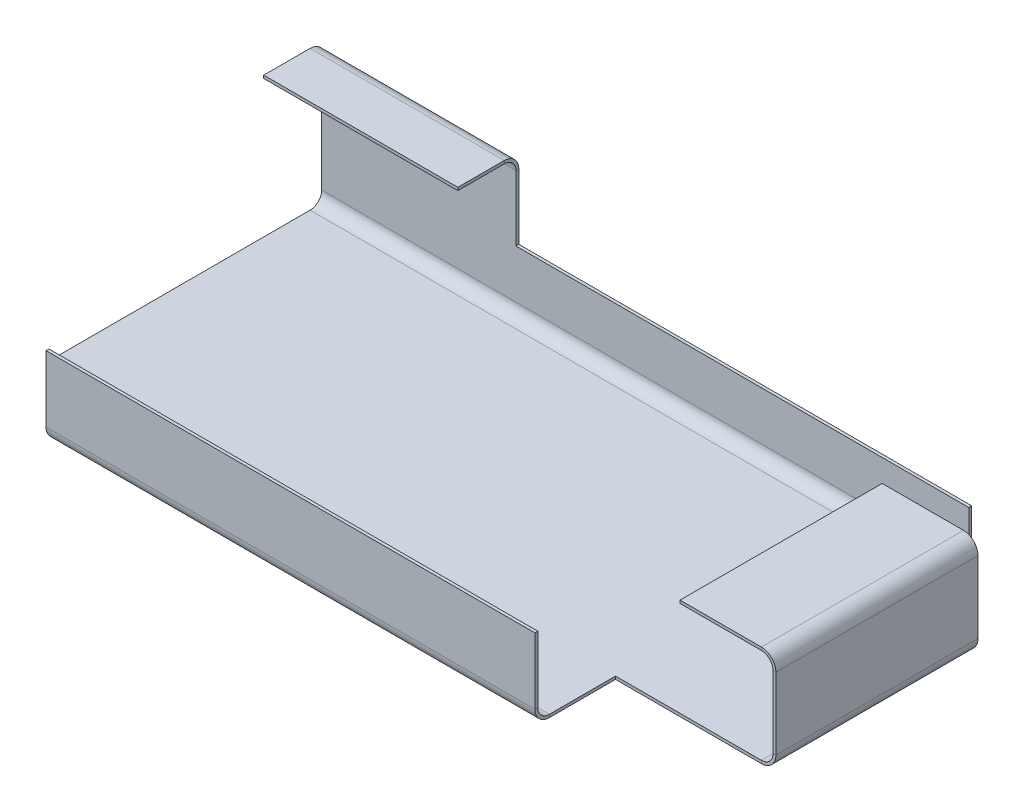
ISO-10303-21;
HEADER;
FILE_DESCRIPTION(('STEP AP214'),'2;1');
FILE_NAME('part.step','',(''),(''),'','','');
FILE_SCHEMA(('AUTOMOTIVE_DESIGN { 1 0 10303 214 1 1 1 1 }'));
ENDSEC;
DATA;
#1=APPLICATION_CONTEXT('core data for automotive mechanical design processes');
#2=APPLICATION_PROTOCOL_DEFINITION('international standard','automotive_design',2000,#1);
#3=PRODUCT_CONTEXT('',#1,'mechanical');
#4=PRODUCT('Part','Part','',(#3));
#5=PRODUCT_RELATED_PRODUCT_CATEGORY('part','',(#4));
#6=PRODUCT_DEFINITION_FORMATION('','',#4);
#7=PRODUCT_DEFINITION_CONTEXT('part definition',#1,'design');
#8=PRODUCT_DEFINITION('design','',#6,#7);
#9=PRODUCT_DEFINITION_SHAPE('','',#8);
#10=(LENGTH_UNIT() NAMED_UNIT(*) SI_UNIT(.MILLI.,.METRE.));
#11=(NAMED_UNIT(*) PLANE_ANGLE_UNIT() SI_UNIT($,.RADIAN.));
#12=(NAMED_UNIT(*) SI_UNIT($,.STERADIAN.) SOLID_ANGLE_UNIT());
#13=UNCERTAINTY_MEASURE_WITH_UNIT(LENGTH_MEASURE(1.E-05),#10,'distance_accuracy_value','');
#14=(GEOMETRIC_REPRESENTATION_CONTEXT(3) GLOBAL_UNCERTAINTY_ASSIGNED_CONTEXT((#13)) GLOBAL_UNIT_ASSIGNED_CONTEXT((#10,
#11,#12)) REPRESENTATION_CONTEXT('',''));
#15=CARTESIAN_POINT('',(0.,0.,0.));
#16=DIRECTION('',(0.,0.,1.));
#17=DIRECTION('',(1.,0.,0.));
#18=AXIS2_PLACEMENT_3D('',#15,#16,#17);
#19=CARTESIAN_POINT('',(0.,24.1533098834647,-35.2286793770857));
#20=DIRECTION('',(0.,0.,-1.));
#21=DIRECTION('',(1.,0.,0.));
#22=AXIS2_PLACEMENT_3D('',#19,#20,#21);
#23=PLANE('',#22);
#24=DIRECTION('',(-1.,0.,0.));
#25=VECTOR('',#24,1.);
#26=CARTESIAN_POINT('',(0.,24.6533098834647,-35.2286793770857));
#27=LINE('',#26,#25);
#28=CARTESIAN_POINT('',(33.4756358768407,24.6533098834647,-35.2286793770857));
#29=VERTEX_POINT('',#28);
#30=CARTESIAN_POINT('',(0.,24.6533098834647,-35.2286793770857));
#31=VERTEX_POINT('',#30);
#32=EDGE_CURVE('E70',#29,#31,#27,.T.);
#33=ORIENTED_EDGE('',*,*,#32,.T.);
#34=DIRECTION('',(0.,1.,0.));
#35=VECTOR('',#34,1.);
#36=CARTESIAN_POINT('',(0.,24.1533098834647,-35.2286793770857));
#37=LINE('',#36,#35);
#38=CARTESIAN_POINT('',(0.,24.1533098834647,-35.2286793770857));
#39=VERTEX_POINT('',#38);
#40=EDGE_CURVE('E375',#39,#31,#37,.T.);
#41=ORIENTED_EDGE('',*,*,#40,.F.);
#42=DIRECTION('',(-1.,0.,0.));
#43=VECTOR('',#42,1.);
#44=CARTESIAN_POINT('',(0.,24.1533098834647,-35.2286793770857));
#45=LINE('',#44,#43);
#46=CARTESIAN_POINT('',(33.4756358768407,24.1533098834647,-35.2286793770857));
#47=VERTEX_POINT('',#46);
#48=EDGE_CURVE('E369',#47,#39,#45,.T.);
#49=ORIENTED_EDGE('',*,*,#48,.F.);
#50=DIRECTION('',(0.,1.,0.));
#51=VECTOR('',#50,1.);
#52=CARTESIAN_POINT('',(33.4756358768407,24.1533098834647,-35.2286793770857));
#53=LINE('',#52,#51);
#54=EDGE_CURVE('E378',#47,#29,#53,.T.);
#55=ORIENTED_EDGE('',*,*,#54,.T.);
#56=EDGE_LOOP('',(#33,#41,#49,#55));
#57=FACE_BOUND('',#56,.T.);
#58=ADVANCED_FACE('F33',(#57),#23,.F.);
#59=CARTESIAN_POINT('',(0.,24.6533098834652,-113.96187884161));
#60=DIRECTION('',(0.,1.,0.));
#61=DIRECTION('',(0.,0.,1.));
#62=AXIS2_PLACEMENT_3D('',#59,#60,#61);
#63=PLANE('',#62);
#64=DIRECTION('',(0.,0.,1.));
#65=VECTOR('',#64,1.);
#66=CARTESIAN_POINT('',(33.4756358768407,24.6533098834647,-35.2286793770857));
#67=LINE('',#66,#65);
#68=CARTESIAN_POINT('',(33.4756358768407,24.6533098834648,-43.2272936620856));
#69=VERTEX_POINT('',#68);
#70=EDGE_CURVE('E11',#69,#29,#67,.T.);
#71=ORIENTED_EDGE('',*,*,#70,.F.);
#72=DIRECTION('',(-1.,0.,0.));
#73=VECTOR('',#72,1.);
#74=CARTESIAN_POINT('',(0.,24.6533098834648,-43.2272936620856));
#75=LINE('',#74,#73);
#76=CARTESIAN_POINT('',(0.,24.6533098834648,-43.2272936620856));
#77=VERTEX_POINT('',#76);
#78=EDGE_CURVE('E336',#69,#77,#75,.T.);
#79=ORIENTED_EDGE('',*,*,#78,.T.);
#80=DIRECTION('',(0.,0.,-1.));
#81=VECTOR('',#80,1.);
#82=CARTESIAN_POINT('',(0.,24.6533098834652,-113.96187884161));
#83=LINE('',#82,#81);
#84=EDGE_CURVE('E373',#31,#77,#83,.T.);
#85=ORIENTED_EDGE('',*,*,#84,.F.);
#86=ORIENTED_EDGE('',*,*,#32,.F.);
#87=EDGE_LOOP('',(#71,#79,#85,#86));
#88=FACE_BOUND('',#87,.T.);
#89=ADVANCED_FACE('F685',(#88),#63,.T.);
#90=CARTESIAN_POINT('',(0.,24.1533098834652,-113.96187884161));
#91=DIRECTION('',(1.,0.,0.));
#92=DIRECTION('',(0.,0.,1.));
#93=AXIS2_PLACEMENT_3D('',#90,#91,#92);
#94=PLANE('',#93);
#95=DIRECTION('',(0.,1.,0.));
#96=VECTOR('',#95,1.);
#97=CARTESIAN_POINT('',(0.,24.1533098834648,-43.2272936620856));
#98=LINE('',#97,#96);
#99=CARTESIAN_POINT('',(0.,24.1533098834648,-43.2272936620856));
#100=VERTEX_POINT('',#99);
#101=EDGE_CURVE('E381',#100,#77,#98,.T.);
#102=ORIENTED_EDGE('',*,*,#101,.F.);
#103=DIRECTION('',(0.,0.,-1.));
#104=VECTOR('',#103,1.);
#105=CARTESIAN_POINT('',(0.,24.1533098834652,-113.96187884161));
#106=LINE('',#105,#104);
#107=EDGE_CURVE('E43',#39,#100,#106,.T.);
#108=ORIENTED_EDGE('',*,*,#107,.F.);
#109=ORIENTED_EDGE('',*,*,#40,.T.);
#110=ORIENTED_EDGE('',*,*,#84,.T.);
#111=EDGE_LOOP('',(#102,#108,#109,#110));
#112=FACE_BOUND('',#111,.T.);
#113=ADVANCED_FACE('F690',(#112),#94,.F.);
#114=CARTESIAN_POINT('',(0.,24.1533098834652,-113.96187884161));
#115=DIRECTION('',(0.,1.,0.));
#116=DIRECTION('',(0.,0.,1.));
#117=AXIS2_PLACEMENT_3D('',#114,#115,#116);
#118=PLANE('',#117);
#119=DIRECTION('',(-1.,0.,0.));
#120=VECTOR('',#119,1.);
#121=CARTESIAN_POINT('',(0.,24.1533098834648,-43.2272936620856));
#122=LINE('',#121,#120);
#123=CARTESIAN_POINT('',(33.4756358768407,24.1533098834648,-43.2272936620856));
#124=VERTEX_POINT('',#123);
#125=EDGE_CURVE('E77',#124,#100,#122,.T.);
#126=ORIENTED_EDGE('',*,*,#125,.F.);
#127=DIRECTION('',(0.,0.,1.));
#128=VECTOR('',#127,1.);
#129=CARTESIAN_POINT('',(33.4756358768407,24.1533098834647,-35.2286793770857));
#130=LINE('',#129,#128);
#131=EDGE_CURVE('E371',#124,#47,#130,.T.);
#132=ORIENTED_EDGE('',*,*,#131,.T.);
#133=ORIENTED_EDGE('',*,*,#48,.T.);
#134=ORIENTED_EDGE('',*,*,#107,.T.);
#135=EDGE_LOOP('',(#126,#132,#133,#134));
#136=FACE_BOUND('',#135,.T.);
#137=ADVANCED_FACE('F697',(#136),#118,.F.);
#138=CARTESIAN_POINT('',(33.4756358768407,24.1533098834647,-35.2286793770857));
#139=DIRECTION('',(-1.,0.,0.));
#140=DIRECTION('',(0.,0.,-1.));
#141=AXIS2_PLACEMENT_3D('',#138,#139,#140);
#142=PLANE('',#141);
#143=DIRECTION('',(0.,-1.,0.));
#144=VECTOR('',#143,1.);
#145=CARTESIAN_POINT('',(33.4756358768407,24.1533098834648,-43.2272936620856));
#146=LINE('',#145,#144);
#147=EDGE_CURVE('E37',#69,#124,#146,.T.);
#148=ORIENTED_EDGE('',*,*,#147,.F.);
#149=ORIENTED_EDGE('',*,*,#70,.T.);
#150=ORIENTED_EDGE('',*,*,#54,.F.);
#151=ORIENTED_EDGE('',*,*,#131,.F.);
#152=EDGE_LOOP('',(#148,#149,#150,#151));
#153=FACE_BOUND('',#152,.T.);
#154=ADVANCED_FACE('F35',(#153),#142,.F.);
#155=CARTESIAN_POINT('',(106.992525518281,16.9021645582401,-34.8382046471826));
#156=DIRECTION('',(1.,0.,0.));
#157=DIRECTION('',(0.,0.,1.));
#158=AXIS2_PLACEMENT_3D('',#155,#156,#157);
#159=PLANE('',#158);
#160=DIRECTION('',(0.,0.,-1.));
#161=VECTOR('',#160,1.);
#162=CARTESIAN_POINT('',(106.992525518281,17.4021645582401,-34.8382046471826));
#163=LINE('',#162,#161);
#164=CARTESIAN_POINT('',(106.992525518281,17.4021645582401,0.));
#165=VERTEX_POINT('',#164);
#166=CARTESIAN_POINT('',(106.992525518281,17.4021645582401,-34.8382046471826));
#167=VERTEX_POINT('',#166);
#168=EDGE_CURVE('E106',#165,#167,#163,.T.);
#169=ORIENTED_EDGE('',*,*,#168,.T.);
#170=DIRECTION('',(0.,1.,0.));
#171=VECTOR('',#170,1.);
#172=CARTESIAN_POINT('',(106.992525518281,16.9021645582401,-34.8382046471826));
#173=LINE('',#172,#171);
#174=CARTESIAN_POINT('',(106.992525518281,16.9021645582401,-34.8382046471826));
#175=VERTEX_POINT('',#174);
#176=EDGE_CURVE('E399',#175,#167,#173,.T.);
#177=ORIENTED_EDGE('',*,*,#176,.F.);
#178=DIRECTION('',(0.,0.,-1.));
#179=VECTOR('',#178,1.);
#180=CARTESIAN_POINT('',(106.992525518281,16.9021645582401,-34.8382046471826));
#181=LINE('',#180,#179);
#182=CARTESIAN_POINT('',(106.992525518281,16.9021645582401,0.));
#183=VERTEX_POINT('',#182);
#184=EDGE_CURVE('E388',#183,#175,#181,.T.);
#185=ORIENTED_EDGE('',*,*,#184,.F.);
#186=DIRECTION('',(0.,1.,0.));
#187=VECTOR('',#186,1.);
#188=CARTESIAN_POINT('',(106.992525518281,16.9021645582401,0.));
#189=LINE('',#188,#187);
#190=EDGE_CURVE('E404',#183,#165,#189,.T.);
#191=ORIENTED_EDGE('',*,*,#190,.T.);
#192=EDGE_LOOP('',(#169,#177,#185,#191));
#193=FACE_BOUND('',#192,.T.);
#194=ADVANCED_FACE('F703',(#193),#159,.F.);
#195=CARTESIAN_POINT('',(262.279096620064,17.4021645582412,0.));
#196=DIRECTION('',(0.,1.,0.));
#197=DIRECTION('',(0.,0.,-1.));
#198=AXIS2_PLACEMENT_3D('',#195,#196,#197);
#199=PLANE('',#198);
#200=DIRECTION('',(-1.,0.,0.));
#201=VECTOR('',#200,1.);
#202=CARTESIAN_POINT('',(106.992525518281,17.4021645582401,0.));
#203=LINE('',#202,#201);
#204=CARTESIAN_POINT('',(121.011475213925,17.4021645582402,0.));
#205=VERTEX_POINT('',#204);
#206=EDGE_CURVE('E86',#205,#165,#203,.T.);
#207=ORIENTED_EDGE('',*,*,#206,.F.);
#208=DIRECTION('',(0.,0.,-1.));
#209=VECTOR('',#208,1.);
#210=CARTESIAN_POINT('',(121.011475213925,17.4021645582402,0.));
#211=LINE('',#210,#209);
#212=CARTESIAN_POINT('',(121.011475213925,17.4021645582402,-34.8382046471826));
#213=VERTEX_POINT('',#212);
#214=EDGE_CURVE('E401',#205,#213,#211,.T.);
#215=ORIENTED_EDGE('',*,*,#214,.T.);
#216=DIRECTION('',(1.,0.,0.));
#217=VECTOR('',#216,1.);
#218=CARTESIAN_POINT('',(150.742829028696,17.4021645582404,-34.8382046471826));
#219=LINE('',#218,#217);
#220=EDGE_CURVE('E397',#167,#213,#219,.T.);
#221=ORIENTED_EDGE('',*,*,#220,.F.);
#222=ORIENTED_EDGE('',*,*,#168,.F.);
#223=EDGE_LOOP('',(#207,#215,#221,#222));
#224=FACE_BOUND('',#223,.T.);
#225=ADVANCED_FACE('F707',(#224),#199,.T.);
#226=CARTESIAN_POINT('',(150.742829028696,16.9021645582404,-34.8382046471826));
#227=DIRECTION('',(0.,0.,1.));
#228=DIRECTION('',(-1.,0.,0.));
#229=AXIS2_PLACEMENT_3D('',#226,#227,#228);
#230=PLANE('',#229);
#231=DIRECTION('',(0.,1.,0.));
#232=VECTOR('',#231,1.);
#233=CARTESIAN_POINT('',(121.011475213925,16.9021645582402,-34.8382046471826));
#234=LINE('',#233,#232);
#235=CARTESIAN_POINT('',(121.011475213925,16.9021645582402,-34.8382046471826));
#236=VERTEX_POINT('',#235);
#237=EDGE_CURVE('E407',#236,#213,#234,.T.);
#238=ORIENTED_EDGE('',*,*,#237,.F.);
#239=DIRECTION('',(1.,0.,0.));
#240=VECTOR('',#239,1.);
#241=CARTESIAN_POINT('',(150.742829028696,16.9021645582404,-34.8382046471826));
#242=LINE('',#241,#240);
#243=EDGE_CURVE('E386',#175,#236,#242,.T.);
#244=ORIENTED_EDGE('',*,*,#243,.F.);
#245=ORIENTED_EDGE('',*,*,#176,.T.);
#246=ORIENTED_EDGE('',*,*,#220,.T.);
#247=EDGE_LOOP('',(#238,#244,#245,#246));
#248=FACE_BOUND('',#247,.T.);
#249=ADVANCED_FACE('F743',(#248),#230,.F.);
#250=CARTESIAN_POINT('',(262.279096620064,16.9021645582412,0.));
#251=DIRECTION('',(0.,1.,0.));
#252=DIRECTION('',(0.,0.,-1.));
#253=AXIS2_PLACEMENT_3D('',#250,#251,#252);
#254=PLANE('',#253);
#255=DIRECTION('',(0.,0.,-1.));
#256=VECTOR('',#255,1.);
#257=CARTESIAN_POINT('',(121.011475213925,16.9021645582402,0.));
#258=LINE('',#257,#256);
#259=CARTESIAN_POINT('',(121.011475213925,16.9021645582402,0.));
#260=VERTEX_POINT('',#259);
#261=EDGE_CURVE('E113',#260,#236,#258,.T.);
#262=ORIENTED_EDGE('',*,*,#261,.F.);
#263=DIRECTION('',(-1.,0.,0.));
#264=VECTOR('',#263,1.);
#265=CARTESIAN_POINT('',(106.992525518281,16.9021645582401,0.));
#266=LINE('',#265,#264);
#267=EDGE_CURVE('E395',#260,#183,#266,.T.);
#268=ORIENTED_EDGE('',*,*,#267,.T.);
#269=ORIENTED_EDGE('',*,*,#184,.T.);
#270=ORIENTED_EDGE('',*,*,#243,.T.);
#271=EDGE_LOOP('',(#262,#268,#269,#270));
#272=FACE_BOUND('',#271,.T.);
#273=ADVANCED_FACE('F747',(#272),#254,.F.);
#274=CARTESIAN_POINT('',(106.992525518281,16.9021645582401,0.));
#275=DIRECTION('',(0.,0.,-1.));
#276=DIRECTION('',(1.,0.,0.));
#277=AXIS2_PLACEMENT_3D('',#274,#275,#276);
#278=PLANE('',#277);
#279=DIRECTION('',(0.,-1.,0.));
#280=VECTOR('',#279,1.);
#281=CARTESIAN_POINT('',(121.011475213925,16.9021645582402,0.));
#282=LINE('',#281,#280);
#283=EDGE_CURVE('E358',#205,#260,#282,.T.);
#284=ORIENTED_EDGE('',*,*,#283,.F.);
#285=ORIENTED_EDGE('',*,*,#206,.T.);
#286=ORIENTED_EDGE('',*,*,#190,.F.);
#287=ORIENTED_EDGE('',*,*,#267,.F.);
#288=EDGE_LOOP('',(#284,#285,#286,#287));
#289=FACE_BOUND('',#288,.T.);
#290=ADVANCED_FACE('F751',(#289),#278,.F.);
#291=CARTESIAN_POINT('',(33.4756358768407,10.889089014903,-45.2272936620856));
#292=DIRECTION('',(0.,-1.,0.));
#293=DIRECTION('',(1.,0.,0.));
#294=AXIS2_PLACEMENT_3D('',#291,#292,#293);
#295=PLANE('',#294);
#296=DIRECTION('',(-1.,0.,0.));
#297=VECTOR('',#296,1.);
#298=CARTESIAN_POINT('',(33.4756358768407,10.889089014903,-45.7272936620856));
#299=LINE('',#298,#297);
#300=CARTESIAN_POINT('',(111.536267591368,10.889089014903,-45.7272936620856));
#301=VERTEX_POINT('',#300);
#302=CARTESIAN_POINT('',(33.4756358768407,10.889089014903,-45.7272936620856));
#303=VERTEX_POINT('',#302);
#304=EDGE_CURVE('E354',#301,#303,#299,.T.);
#305=ORIENTED_EDGE('',*,*,#304,.T.);
#306=DIRECTION('',(0.,0.,-1.));
#307=VECTOR('',#306,1.);
#308=CARTESIAN_POINT('',(33.4756358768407,10.889089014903,-45.2272936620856));
#309=LINE('',#308,#307);
#310=CARTESIAN_POINT('',(33.4756358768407,10.889089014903,-45.2272936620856));
#311=VERTEX_POINT('',#310);
#312=EDGE_CURVE('E324',#311,#303,#309,.T.);
#313=ORIENTED_EDGE('',*,*,#312,.F.);
#314=DIRECTION('',(-1.,0.,0.));
#315=VECTOR('',#314,1.);
#316=CARTESIAN_POINT('',(33.4756358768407,10.889089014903,-45.2272936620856));
#317=LINE('',#316,#315);
#318=CARTESIAN_POINT('',(111.536267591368,10.889089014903,-45.2272936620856));
#319=VERTEX_POINT('',#318);
#320=EDGE_CURVE('E417',#319,#311,#317,.T.);
#321=ORIENTED_EDGE('',*,*,#320,.F.);
#322=DIRECTION('',(0.,0.,-1.));
#323=VECTOR('',#322,1.);
#324=CARTESIAN_POINT('',(111.536267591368,10.889089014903,-45.2272936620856));
#325=LINE('',#324,#323);
#326=EDGE_CURVE('E352',#319,#301,#325,.T.);
#327=ORIENTED_EDGE('',*,*,#326,.T.);
#328=EDGE_LOOP('',(#305,#313,#321,#327));
#329=FACE_BOUND('',#328,.T.);
#330=ADVANCED_FACE('F720',(#329),#295,.F.);
#331=CARTESIAN_POINT('',(33.4756358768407,34.0789149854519,-45.2272936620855));
#332=DIRECTION('',(-1.,0.,0.));
#333=DIRECTION('',(0.,-1.,0.));
#334=AXIS2_PLACEMENT_3D('',#331,#332,#333);
#335=PLANE('',#334);
#336=DIRECTION('',(0.,1.,0.));
#337=VECTOR('',#336,1.);
#338=CARTESIAN_POINT('',(33.4756358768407,34.0789149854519,-45.7272936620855));
#339=LINE('',#338,#337);
#340=CARTESIAN_POINT('',(33.4756358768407,22.1533098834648,-45.7272936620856));
#341=VERTEX_POINT('',#340);
#342=EDGE_CURVE('E325',#303,#341,#339,.T.);
#343=ORIENTED_EDGE('',*,*,#342,.T.);
#344=DIRECTION('',(0.,0.,1.));
#345=VECTOR('',#344,1.);
#346=CARTESIAN_POINT('',(33.4756358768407,22.1533098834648,-45.2272936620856));
#347=LINE('',#346,#345);
#348=CARTESIAN_POINT('',(33.4756358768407,22.1533098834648,-45.2272936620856));
#349=VERTEX_POINT('',#348);
#350=EDGE_CURVE('E313',#341,#349,#347,.T.);
#351=ORIENTED_EDGE('',*,*,#350,.T.);
#352=DIRECTION('',(0.,1.,0.));
#353=VECTOR('',#352,1.);
#354=CARTESIAN_POINT('',(33.4756358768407,34.0789149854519,-45.2272936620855));
#355=LINE('',#354,#353);
#356=EDGE_CURVE('E364',#311,#349,#355,.T.);
#357=ORIENTED_EDGE('',*,*,#356,.F.);
#358=ORIENTED_EDGE('',*,*,#312,.T.);
#359=EDGE_LOOP('',(#343,#351,#357,#358));
#360=FACE_BOUND('',#359,.T.);
#361=ADVANCED_FACE('F350',(#360),#335,.F.);
#362=CARTESIAN_POINT('',(0.,-44.6542844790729,-45.7272936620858));
#363=DIRECTION('',(0.,0.,-1.));
#364=DIRECTION('',(0.,1.,0.));
#365=AXIS2_PLACEMENT_3D('',#362,#363,#364);
#366=PLANE('',#365);
#367=DIRECTION('',(-1.,0.,0.));
#368=VECTOR('',#367,1.);
#369=CARTESIAN_POINT('',(0.,22.1533098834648,-45.7272936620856));
#370=LINE('',#369,#368);
#371=CARTESIAN_POINT('',(0.,22.1533098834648,-45.7272936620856));
#372=VERTEX_POINT('',#371);
#373=EDGE_CURVE('E333',#341,#372,#370,.T.);
#374=ORIENTED_EDGE('',*,*,#373,.F.);
#375=ORIENTED_EDGE('',*,*,#342,.F.);
#376=ORIENTED_EDGE('',*,*,#304,.F.);
#377=DIRECTION('',(0.,1.,0.));
#378=VECTOR('',#377,1.);
#379=CARTESIAN_POINT('',(111.536267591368,10.889089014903,-45.7272936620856));
#380=LINE('',#379,#378);
#381=CARTESIAN_POINT('',(111.536267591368,2.50000000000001,-45.7272936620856));
#382=VERTEX_POINT('',#381);
#383=EDGE_CURVE('E122',#382,#301,#380,.T.);
#384=ORIENTED_EDGE('',*,*,#383,.F.);
#385=DIRECTION('',(-1.,0.,0.));
#386=VECTOR('',#385,1.);
#387=CARTESIAN_POINT('',(0.,2.50000000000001,-45.7272936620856));
#388=LINE('',#387,#386);
#389=CARTESIAN_POINT('',(0.,2.50000000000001,-45.7272936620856));
#390=VERTEX_POINT('',#389);
#391=EDGE_CURVE('E347',#382,#390,#388,.T.);
#392=ORIENTED_EDGE('',*,*,#391,.T.);
#393=DIRECTION('',(0.,-1.,0.));
#394=VECTOR('',#393,1.);
#395=CARTESIAN_POINT('',(0.,-44.6542844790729,-45.7272936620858));
#396=LINE('',#395,#394);
#397=EDGE_CURVE('E346',#372,#390,#396,.T.);
#398=ORIENTED_EDGE('',*,*,#397,.F.);
#399=EDGE_LOOP('',(#374,#375,#376,#384,#392,#398));
#400=FACE_BOUND('',#399,.T.);
#401=ADVANCED_FACE('F343',(#400),#366,.T.);
#402=CARTESIAN_POINT('',(0.,-44.6542844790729,-45.2272936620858));
#403=DIRECTION('',(1.,0.,0.));
#404=DIRECTION('',(0.,1.,0.));
#405=AXIS2_PLACEMENT_3D('',#402,#403,#404);
#406=PLANE('',#405);
#407=DIRECTION('',(0.,-1.,0.));
#408=VECTOR('',#407,1.);
#409=CARTESIAN_POINT('',(0.,-44.6542844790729,-45.2272936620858));
#410=LINE('',#409,#408);
#411=CARTESIAN_POINT('',(0.,22.1533098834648,-45.2272936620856));
#412=VERTEX_POINT('',#411);
#413=CARTESIAN_POINT('',(0.,2.50000000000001,-45.2272936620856));
#414=VERTEX_POINT('',#413);
#415=EDGE_CURVE('E360',#412,#414,#410,.T.);
#416=ORIENTED_EDGE('',*,*,#415,.F.);
#417=DIRECTION('',(0.,0.,-1.));
#418=VECTOR('',#417,1.);
#419=CARTESIAN_POINT('',(0.,22.1533098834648,-45.2272936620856));
#420=LINE('',#419,#418);
#421=EDGE_CURVE('E366',#412,#372,#420,.T.);
#422=ORIENTED_EDGE('',*,*,#421,.T.);
#423=ORIENTED_EDGE('',*,*,#397,.T.);
#424=DIRECTION('',(0.,0.,-1.));
#425=VECTOR('',#424,1.);
#426=CARTESIAN_POINT('',(0.,2.50000000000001,-45.2272936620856));
#427=LINE('',#426,#425);
#428=EDGE_CURVE('E431',#414,#390,#427,.T.);
#429=ORIENTED_EDGE('',*,*,#428,.F.);
#430=EDGE_LOOP('',(#416,#422,#423,#429));
#431=FACE_BOUND('',#430,.T.);
#432=ADVANCED_FACE('F672',(#431),#406,.F.);
#433=CARTESIAN_POINT('',(0.,-44.6542844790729,-45.2272936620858));
#434=DIRECTION('',(0.,0.,-1.));
#435=DIRECTION('',(0.,1.,0.));
#436=AXIS2_PLACEMENT_3D('',#433,#434,#435);
#437=PLANE('',#436);
#438=ORIENTED_EDGE('',*,*,#356,.T.);
#439=DIRECTION('',(-1.,0.,0.));
#440=VECTOR('',#439,1.);
#441=CARTESIAN_POINT('',(0.,22.1533098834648,-45.2272936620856));
#442=LINE('',#441,#440);
#443=EDGE_CURVE('E363',#349,#412,#442,.T.);
#444=ORIENTED_EDGE('',*,*,#443,.T.);
#445=ORIENTED_EDGE('',*,*,#415,.T.);
#446=DIRECTION('',(-1.,0.,0.));
#447=VECTOR('',#446,1.);
#448=CARTESIAN_POINT('',(0.,2.50000000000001,-45.2272936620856));
#449=LINE('',#448,#447);
#450=CARTESIAN_POINT('',(111.536267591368,2.50000000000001,-45.2272936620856));
#451=VERTEX_POINT('',#450);
#452=EDGE_CURVE('E145',#451,#414,#449,.T.);
#453=ORIENTED_EDGE('',*,*,#452,.F.);
#454=DIRECTION('',(0.,1.,0.));
#455=VECTOR('',#454,1.);
#456=CARTESIAN_POINT('',(111.536267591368,10.889089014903,-45.2272936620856));
#457=LINE('',#456,#455);
#458=EDGE_CURVE('E362',#451,#319,#457,.T.);
#459=ORIENTED_EDGE('',*,*,#458,.T.);
#460=ORIENTED_EDGE('',*,*,#320,.T.);
#461=EDGE_LOOP('',(#438,#444,#445,#453,#459,#460));
#462=FACE_BOUND('',#461,.T.);
#463=ADVANCED_FACE('F717',(#462),#437,.F.);
#464=CARTESIAN_POINT('',(111.536267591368,10.889089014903,-45.2272936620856));
#465=DIRECTION('',(-1.,0.,0.));
#466=DIRECTION('',(0.,-1.,0.));
#467=AXIS2_PLACEMENT_3D('',#464,#465,#466);
#468=PLANE('',#467);
#469=DIRECTION('',(0.,0.,1.));
#470=VECTOR('',#469,1.);
#471=CARTESIAN_POINT('',(111.536267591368,2.50000000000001,-45.2272936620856));
#472=LINE('',#471,#470);
#473=EDGE_CURVE('E149',#382,#451,#472,.T.);
#474=ORIENTED_EDGE('',*,*,#473,.F.);
#475=ORIENTED_EDGE('',*,*,#383,.T.);
#476=ORIENTED_EDGE('',*,*,#326,.F.);
#477=ORIENTED_EDGE('',*,*,#458,.F.);
#478=EDGE_LOOP('',(#474,#475,#476,#477));
#479=FACE_BOUND('',#478,.T.);
#480=ADVANCED_FACE('F721',(#479),#468,.F.);
#481=CARTESIAN_POINT('',(123.511475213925,-122.438466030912,0.));
#482=DIRECTION('',(1.,0.,0.));
#483=DIRECTION('',(0.,0.,-1.));
#484=AXIS2_PLACEMENT_3D('',#481,#482,#483);
#485=PLANE('',#484);
#486=DIRECTION('',(0.,0.,-1.));
#487=VECTOR('',#486,1.);
#488=CARTESIAN_POINT('',(123.511475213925,14.9021645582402,0.));
#489=LINE('',#488,#487);
#490=CARTESIAN_POINT('',(123.511475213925,14.9021645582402,0.));
#491=VERTEX_POINT('',#490);
#492=CARTESIAN_POINT('',(123.511475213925,14.9021645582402,-34.8382046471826));
#493=VERTEX_POINT('',#492);
#494=EDGE_CURVE('E448',#491,#493,#489,.T.);
#495=ORIENTED_EDGE('',*,*,#494,.F.);
#496=DIRECTION('',(0.,1.,0.));
#497=VECTOR('',#496,1.);
#498=CARTESIAN_POINT('',(123.511475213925,32.8481050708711,0.));
#499=LINE('',#498,#497);
#500=CARTESIAN_POINT('',(123.511475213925,2.5,0.));
#501=VERTEX_POINT('',#500);
#502=EDGE_CURVE('E436',#501,#491,#499,.T.);
#503=ORIENTED_EDGE('',*,*,#502,.F.);
#504=DIRECTION('',(0.,0.,-1.));
#505=VECTOR('',#504,1.);
#506=CARTESIAN_POINT('',(123.511475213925,2.5,0.));
#507=LINE('',#506,#505);
#508=CARTESIAN_POINT('',(123.511475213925,2.50000000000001,-34.8382046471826));
#509=VERTEX_POINT('',#508);
#510=EDGE_CURVE('E446',#501,#509,#507,.T.);
#511=ORIENTED_EDGE('',*,*,#510,.T.);
#512=DIRECTION('',(0.,-1.,0.));
#513=VECTOR('',#512,1.);
#514=CARTESIAN_POINT('',(123.511475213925,-10.9021984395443,-34.8382046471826));
#515=LINE('',#514,#513);
#516=EDGE_CURVE('E391',#493,#509,#515,.T.);
#517=ORIENTED_EDGE('',*,*,#516,.F.);
#518=EDGE_LOOP('',(#495,#503,#511,#517));
#519=FACE_BOUND('',#518,.T.);
#520=ADVANCED_FACE('F581',(#519),#485,.T.);
#521=CARTESIAN_POINT('',(123.011475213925,-10.9021984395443,-34.8382046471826));
#522=DIRECTION('',(0.,0.,1.));
#523=DIRECTION('',(0.,1.,0.));
#524=AXIS2_PLACEMENT_3D('',#521,#522,#523);
#525=PLANE('',#524);
#526=DIRECTION('',(0.,-1.,0.));
#527=VECTOR('',#526,1.);
#528=CARTESIAN_POINT('',(123.011475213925,-10.9021984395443,-34.8382046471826));
#529=LINE('',#528,#527);
#530=CARTESIAN_POINT('',(123.011475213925,14.9021645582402,-34.8382046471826));
#531=VERTEX_POINT('',#530);
#532=CARTESIAN_POINT('',(123.011475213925,2.5,-34.8382046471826));
#533=VERTEX_POINT('',#532);
#534=EDGE_CURVE('E157',#531,#533,#529,.T.);
#535=ORIENTED_EDGE('',*,*,#534,.F.);
#536=DIRECTION('',(1.,0.,0.));
#537=VECTOR('',#536,1.);
#538=CARTESIAN_POINT('',(123.011475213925,14.9021645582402,-34.8382046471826));
#539=LINE('',#538,#537);
#540=EDGE_CURVE('E442',#531,#493,#539,.T.);
#541=ORIENTED_EDGE('',*,*,#540,.T.);
#542=ORIENTED_EDGE('',*,*,#516,.T.);
#543=DIRECTION('',(1.,0.,0.));
#544=VECTOR('',#543,1.);
#545=CARTESIAN_POINT('',(123.011475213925,2.5,-34.8382046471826));
#546=LINE('',#545,#544);
#547=EDGE_CURVE('E454',#533,#509,#546,.T.);
#548=ORIENTED_EDGE('',*,*,#547,.F.);
#549=EDGE_LOOP('',(#535,#541,#542,#548));
#550=FACE_BOUND('',#549,.T.);
#551=ADVANCED_FACE('F728',(#550),#525,.F.);
#552=CARTESIAN_POINT('',(123.011475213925,-122.438466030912,0.));
#553=DIRECTION('',(1.,0.,0.));
#554=DIRECTION('',(0.,0.,-1.));
#555=AXIS2_PLACEMENT_3D('',#552,#553,#554);
#556=PLANE('',#555);
#557=DIRECTION('',(0.,1.,0.));
#558=VECTOR('',#557,1.);
#559=CARTESIAN_POINT('',(123.011475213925,32.8481050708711,0.));
#560=LINE('',#559,#558);
#561=CARTESIAN_POINT('',(123.011475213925,2.5,0.));
#562=VERTEX_POINT('',#561);
#563=CARTESIAN_POINT('',(123.011475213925,14.9021645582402,0.));
#564=VERTEX_POINT('',#563);
#565=EDGE_CURVE('E439',#562,#564,#560,.T.);
#566=ORIENTED_EDGE('',*,*,#565,.T.);
#567=DIRECTION('',(0.,0.,-1.));
#568=VECTOR('',#567,1.);
#569=CARTESIAN_POINT('',(123.011475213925,14.9021645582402,0.));
#570=LINE('',#569,#568);
#571=EDGE_CURVE('E438',#564,#531,#570,.T.);
#572=ORIENTED_EDGE('',*,*,#571,.T.);
#573=ORIENTED_EDGE('',*,*,#534,.T.);
#574=DIRECTION('',(0.,0.,-1.));
#575=VECTOR('',#574,1.);
#576=CARTESIAN_POINT('',(123.011475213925,2.5,0.));
#577=LINE('',#576,#575);
#578=EDGE_CURVE('E167',#562,#533,#577,.T.);
#579=ORIENTED_EDGE('',*,*,#578,.F.);
#580=EDGE_LOOP('',(#566,#572,#573,#579));
#581=FACE_BOUND('',#580,.T.);
#582=ADVANCED_FACE('F735',(#581),#556,.F.);
#583=CARTESIAN_POINT('',(123.011475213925,32.8481050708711,0.));
#584=DIRECTION('',(0.,0.,-1.));
#585=DIRECTION('',(0.,-1.,0.));
#586=AXIS2_PLACEMENT_3D('',#583,#584,#585);
#587=PLANE('',#586);
#588=ORIENTED_EDGE('',*,*,#502,.T.);
#589=DIRECTION('',(-1.,0.,0.));
#590=VECTOR('',#589,1.);
#591=CARTESIAN_POINT('',(123.011475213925,14.9021645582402,0.));
#592=LINE('',#591,#590);
#593=EDGE_CURVE('E435',#491,#564,#592,.T.);
#594=ORIENTED_EDGE('',*,*,#593,.T.);
#595=ORIENTED_EDGE('',*,*,#565,.F.);
#596=DIRECTION('',(-1.,0.,0.));
#597=VECTOR('',#596,1.);
#598=CARTESIAN_POINT('',(123.011475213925,2.5,0.));
#599=LINE('',#598,#597);
#600=EDGE_CURVE('E174',#501,#562,#599,.T.);
#601=ORIENTED_EDGE('',*,*,#600,.F.);
#602=EDGE_LOOP('',(#588,#594,#595,#601));
#603=FACE_BOUND('',#602,.T.);
#604=ADVANCED_FACE('F567',(#603),#587,.F.);
#605=CARTESIAN_POINT('',(95.8725786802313,13.9046528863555,13.4046528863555));
#606=DIRECTION('',(0.,-1.,0.));
#607=DIRECTION('',(-1.,0.,0.));
#608=AXIS2_PLACEMENT_3D('',#605,#606,#607);
#609=PLANE('',#608);
#610=DIRECTION('',(1.,0.,0.));
#611=VECTOR('',#610,1.);
#612=CARTESIAN_POINT('',(95.8725786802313,13.9046528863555,13.9046528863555));
#613=LINE('',#612,#611);
#614=CARTESIAN_POINT('',(11.6127348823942,13.9046528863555,13.9046528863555));
#615=VERTEX_POINT('',#614);
#616=CARTESIAN_POINT('',(95.8725786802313,13.9046528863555,13.9046528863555));
#617=VERTEX_POINT('',#616);
#618=EDGE_CURVE('E554',#615,#617,#613,.T.);
#619=ORIENTED_EDGE('',*,*,#618,.T.);
#620=DIRECTION('',(0.,0.,1.));
#621=VECTOR('',#620,1.);
#622=CARTESIAN_POINT('',(95.8725786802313,13.9046528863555,13.4046528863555));
#623=LINE('',#622,#621);
#624=CARTESIAN_POINT('',(95.8725786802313,13.9046528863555,13.4046528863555));
#625=VERTEX_POINT('',#624);
#626=EDGE_CURVE('E546',#625,#617,#623,.T.);
#627=ORIENTED_EDGE('',*,*,#626,.F.);
#628=DIRECTION('',(1.,0.,0.));
#629=VECTOR('',#628,1.);
#630=CARTESIAN_POINT('',(95.8725786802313,13.9046528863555,13.4046528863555));
#631=LINE('',#630,#629);
#632=CARTESIAN_POINT('',(11.6127348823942,13.9046528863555,13.4046528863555));
#633=VERTEX_POINT('',#632);
#634=EDGE_CURVE('E540',#633,#625,#631,.T.);
#635=ORIENTED_EDGE('',*,*,#634,.F.);
#636=DIRECTION('',(0.,0.,1.));
#637=VECTOR('',#636,1.);
#638=CARTESIAN_POINT('',(11.6127348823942,13.9046528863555,13.4046528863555));
#639=LINE('',#638,#637);
#640=EDGE_CURVE('E552',#633,#615,#639,.T.);
#641=ORIENTED_EDGE('',*,*,#640,.T.);
#642=EDGE_LOOP('',(#619,#627,#635,#641));
#643=FACE_BOUND('',#642,.T.);
#644=ADVANCED_FACE('F739',(#643),#609,.F.);
#645=CARTESIAN_POINT('',(0.,-12.8316437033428,13.9046528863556));
#646=DIRECTION('',(0.,0.,1.));
#647=DIRECTION('',(0.,-1.,0.));
#648=AXIS2_PLACEMENT_3D('',#645,#646,#647);
#649=PLANE('',#648);
#650=DIRECTION('',(0.,1.,0.));
#651=VECTOR('',#650,1.);
#652=CARTESIAN_POINT('',(11.6127348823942,13.9046528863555,13.9046528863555));
#653=LINE('',#652,#651);
#654=CARTESIAN_POINT('',(11.6127348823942,2.50000000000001,13.9046528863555));
#655=VERTEX_POINT('',#654);
#656=EDGE_CURVE('E183',#655,#615,#653,.T.);
#657=ORIENTED_EDGE('',*,*,#656,.F.);
#658=DIRECTION('',(1.,0.,0.));
#659=VECTOR('',#658,1.);
#660=CARTESIAN_POINT('',(0.,2.50000000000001,13.9046528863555));
#661=LINE('',#660,#659);
#662=CARTESIAN_POINT('',(95.8725786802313,2.50000000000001,13.9046528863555));
#663=VERTEX_POINT('',#662);
#664=EDGE_CURVE('E549',#655,#663,#661,.T.);
#665=ORIENTED_EDGE('',*,*,#664,.T.);
#666=DIRECTION('',(0.,-1.,0.));
#667=VECTOR('',#666,1.);
#668=CARTESIAN_POINT('',(95.8725786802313,-12.8316437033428,13.9046528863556));
#669=LINE('',#668,#667);
#670=EDGE_CURVE('E544',#617,#663,#669,.T.);
#671=ORIENTED_EDGE('',*,*,#670,.F.);
#672=ORIENTED_EDGE('',*,*,#618,.F.);
#673=EDGE_LOOP('',(#657,#665,#671,#672));
#674=FACE_BOUND('',#673,.T.);
#675=ADVANCED_FACE('F803',(#674),#649,.T.);
#676=CARTESIAN_POINT('',(95.8725786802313,-12.8316437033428,13.4046528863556));
#677=DIRECTION('',(-1.,0.,0.));
#678=DIRECTION('',(0.,1.,0.));
#679=AXIS2_PLACEMENT_3D('',#676,#677,#678);
#680=PLANE('',#679);
#681=DIRECTION('',(0.,0.,1.));
#682=VECTOR('',#681,1.);
#683=CARTESIAN_POINT('',(95.8725786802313,2.50000000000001,13.4046528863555));
#684=LINE('',#683,#682);
#685=CARTESIAN_POINT('',(95.8725786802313,2.50000000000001,13.4046528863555));
#686=VERTEX_POINT('',#685);
#687=EDGE_CURVE('E205',#686,#663,#684,.T.);
#688=ORIENTED_EDGE('',*,*,#687,.F.);
#689=DIRECTION('',(0.,-1.,0.));
#690=VECTOR('',#689,1.);
#691=CARTESIAN_POINT('',(95.8725786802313,-12.8316437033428,13.4046528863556));
#692=LINE('',#691,#690);
#693=EDGE_CURVE('E538',#625,#686,#692,.T.);
#694=ORIENTED_EDGE('',*,*,#693,.F.);
#695=ORIENTED_EDGE('',*,*,#626,.T.);
#696=ORIENTED_EDGE('',*,*,#670,.T.);
#697=EDGE_LOOP('',(#688,#694,#695,#696));
#698=FACE_BOUND('',#697,.T.);
#699=ADVANCED_FACE('F813',(#698),#680,.F.);
#700=CARTESIAN_POINT('',(0.,-12.8316437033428,13.4046528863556));
#701=DIRECTION('',(0.,0.,1.));
#702=DIRECTION('',(0.,-1.,0.));
#703=AXIS2_PLACEMENT_3D('',#700,#701,#702);
#704=PLANE('',#703);
#705=DIRECTION('',(1.,0.,0.));
#706=VECTOR('',#705,1.);
#707=CARTESIAN_POINT('',(0.,2.50000000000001,13.4046528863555));
#708=LINE('',#707,#706);
#709=CARTESIAN_POINT('',(11.6127348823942,2.50000000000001,13.4046528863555));
#710=VERTEX_POINT('',#709);
#711=EDGE_CURVE('E557',#710,#686,#708,.T.);
#712=ORIENTED_EDGE('',*,*,#711,.F.);
#713=DIRECTION('',(0.,1.,0.));
#714=VECTOR('',#713,1.);
#715=CARTESIAN_POINT('',(11.6127348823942,13.9046528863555,13.4046528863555));
#716=LINE('',#715,#714);
#717=EDGE_CURVE('E542',#710,#633,#716,.T.);
#718=ORIENTED_EDGE('',*,*,#717,.T.);
#719=ORIENTED_EDGE('',*,*,#634,.T.);
#720=ORIENTED_EDGE('',*,*,#693,.T.);
#721=EDGE_LOOP('',(#712,#718,#719,#720));
#722=FACE_BOUND('',#721,.T.);
#723=ADVANCED_FACE('F823',(#722),#704,.F.);
#724=CARTESIAN_POINT('',(11.6127348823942,13.9046528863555,13.4046528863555));
#725=DIRECTION('',(1.,0.,0.));
#726=DIRECTION('',(0.,-1.,0.));
#727=AXIS2_PLACEMENT_3D('',#724,#725,#726);
#728=PLANE('',#727);
#729=DIRECTION('',(0.,0.,-1.));
#730=VECTOR('',#729,1.);
#731=CARTESIAN_POINT('',(11.6127348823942,2.50000000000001,13.4046528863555));
#732=LINE('',#731,#730);
#733=EDGE_CURVE('E209',#655,#710,#732,.T.);
#734=ORIENTED_EDGE('',*,*,#733,.F.);
#735=ORIENTED_EDGE('',*,*,#656,.T.);
#736=ORIENTED_EDGE('',*,*,#640,.F.);
#737=ORIENTED_EDGE('',*,*,#717,.F.);
#738=EDGE_LOOP('',(#734,#735,#736,#737));
#739=FACE_BOUND('',#738,.T.);
#740=ADVANCED_FACE('F832',(#739),#728,.F.);
#741=CARTESIAN_POINT('',(0.,0.5,0.));
#742=DIRECTION('',(0.,-1.,0.));
#743=DIRECTION('',(0.,0.,-1.));
#744=AXIS2_PLACEMENT_3D('',#741,#742,#743);
#745=PLANE('',#744);
#746=DIRECTION('',(0.,0.,-1.));
#747=VECTOR('',#746,1.);
#748=CARTESIAN_POINT('',(111.536267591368,0.5,-55.5433734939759));
#749=LINE('',#748,#747);
#750=CARTESIAN_POINT('',(111.536267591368,0.5,-34.8382046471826));
#751=VERTEX_POINT('',#750);
#752=CARTESIAN_POINT('',(111.536267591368,0.5,-43.2272936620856));
#753=VERTEX_POINT('',#752);
#754=EDGE_CURVE('E462',#751,#753,#749,.T.);
#755=ORIENTED_EDGE('',*,*,#754,.T.);
#756=DIRECTION('',(-1.,0.,0.));
#757=VECTOR('',#756,1.);
#758=CARTESIAN_POINT('',(0.,0.5,-43.2272936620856));
#759=LINE('',#758,#757);
#760=CARTESIAN_POINT('',(0.,0.5,-43.2272936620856));
#761=VERTEX_POINT('',#760);
#762=EDGE_CURVE('E520',#753,#761,#759,.T.);
#763=ORIENTED_EDGE('',*,*,#762,.T.);
#764=DIRECTION('',(0.,0.,1.));
#765=VECTOR('',#764,1.);
#766=CARTESIAN_POINT('',(0.,0.5,0.));
#767=LINE('',#766,#765);
#768=CARTESIAN_POINT('',(0.,0.5,0.));
#769=VERTEX_POINT('',#768);
#770=EDGE_CURVE('E464',#761,#769,#767,.T.);
#771=ORIENTED_EDGE('',*,*,#770,.T.);
#772=DIRECTION('',(1.,0.,0.));
#773=VECTOR('',#772,1.);
#774=CARTESIAN_POINT('',(11.6127348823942,0.5,0.));
#775=LINE('',#774,#773);
#776=CARTESIAN_POINT('',(11.6127348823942,0.5,0.));
#777=VERTEX_POINT('',#776);
#778=EDGE_CURVE('E534',#769,#777,#775,.T.);
#779=ORIENTED_EDGE('',*,*,#778,.T.);
#780=DIRECTION('',(0.,0.,1.));
#781=VECTOR('',#780,1.);
#782=CARTESIAN_POINT('',(11.6127348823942,0.5,26.7362965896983));
#783=LINE('',#782,#781);
#784=CARTESIAN_POINT('',(11.6127348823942,0.5,11.4046528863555));
#785=VERTEX_POINT('',#784);
#786=EDGE_CURVE('E531',#777,#785,#783,.T.);
#787=ORIENTED_EDGE('',*,*,#786,.T.);
#788=DIRECTION('',(1.,0.,0.));
#789=VECTOR('',#788,1.);
#790=CARTESIAN_POINT('',(0.,0.5,11.4046528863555));
#791=LINE('',#790,#789);
#792=CARTESIAN_POINT('',(95.8725786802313,0.5,11.4046528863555));
#793=VERTEX_POINT('',#792);
#794=EDGE_CURVE('E491',#785,#793,#791,.T.);
#795=ORIENTED_EDGE('',*,*,#794,.T.);
#796=DIRECTION('',(0.,0.,-1.));
#797=VECTOR('',#796,1.);
#798=CARTESIAN_POINT('',(95.8725786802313,0.5,0.));
#799=LINE('',#798,#797);
#800=CARTESIAN_POINT('',(95.8725786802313,0.5,0.));
#801=VERTEX_POINT('',#800);
#802=EDGE_CURVE('E528',#793,#801,#799,.T.);
#803=ORIENTED_EDGE('',*,*,#802,.T.);
#804=DIRECTION('',(1.,0.,0.));
#805=VECTOR('',#804,1.);
#806=CARTESIAN_POINT('',(155.286571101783,0.5,0.));
#807=LINE('',#806,#805);
#808=CARTESIAN_POINT('',(121.011475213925,0.500000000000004,0.));
#809=VERTEX_POINT('',#808);
#810=EDGE_CURVE('E530',#801,#809,#807,.T.);
#811=ORIENTED_EDGE('',*,*,#810,.T.);
#812=DIRECTION('',(0.,0.,-1.));
#813=VECTOR('',#812,1.);
#814=CARTESIAN_POINT('',(121.011475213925,0.5,0.));
#815=LINE('',#814,#813);
#816=CARTESIAN_POINT('',(121.011475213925,0.500000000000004,-34.8382046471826));
#817=VERTEX_POINT('',#816);
#818=EDGE_CURVE('E509',#809,#817,#815,.T.);
#819=ORIENTED_EDGE('',*,*,#818,.T.);
#820=DIRECTION('',(-1.,0.,0.));
#821=VECTOR('',#820,1.);
#822=CARTESIAN_POINT('',(111.536267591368,0.5,-34.8382046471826));
#823=LINE('',#822,#821);
#824=EDGE_CURVE('E465',#817,#751,#823,.T.);
#825=ORIENTED_EDGE('',*,*,#824,.T.);
#826=EDGE_LOOP('',(#755,#763,#771,#779,#787,#795,#803,#811,#819,#825));
#827=FACE_BOUND('',#826,.T.);
#828=ADVANCED_FACE('F626',(#827),#745,.F.);
#829=CARTESIAN_POINT('',(111.536267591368,0.5,-55.5433734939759));
#830=DIRECTION('',(-1.,0.,0.));
#831=DIRECTION('',(0.,0.,1.));
#832=AXIS2_PLACEMENT_3D('',#829,#830,#831);
#833=PLANE('',#832);
#834=DIRECTION('',(0.,0.,-1.));
#835=VECTOR('',#834,1.);
#836=CARTESIAN_POINT('',(111.536267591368,0.,-55.5433734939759));
#837=LINE('',#836,#835);
#838=CARTESIAN_POINT('',(111.536267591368,0.,-34.8382046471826));
#839=VERTEX_POINT('',#838);
#840=CARTESIAN_POINT('',(111.536267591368,0.,-43.2272936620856));
#841=VERTEX_POINT('',#840);
#842=EDGE_CURVE('E458',#839,#841,#837,.T.);
#843=ORIENTED_EDGE('',*,*,#842,.T.);
#844=DIRECTION('',(0.,1.,0.));
#845=VECTOR('',#844,1.);
#846=CARTESIAN_POINT('',(111.536267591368,0.500000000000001,-43.2272936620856));
#847=LINE('',#846,#845);
#848=EDGE_CURVE('E517',#841,#753,#847,.T.);
#849=ORIENTED_EDGE('',*,*,#848,.T.);
#850=ORIENTED_EDGE('',*,*,#754,.F.);
#851=DIRECTION('',(0.,-1.,0.));
#852=VECTOR('',#851,1.);
#853=CARTESIAN_POINT('',(111.536267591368,0.5,-34.8382046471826));
#854=LINE('',#853,#852);
#855=EDGE_CURVE('E473',#751,#839,#854,.T.);
#856=ORIENTED_EDGE('',*,*,#855,.T.);
#857=EDGE_LOOP('',(#843,#849,#850,#856));
#858=FACE_BOUND('',#857,.T.);
#859=ADVANCED_FACE('F646',(#858),#833,.F.);
#860=CARTESIAN_POINT('',(0.,0.5,0.));
#861=DIRECTION('',(1.,0.,0.));
#862=DIRECTION('',(0.,0.,-1.));
#863=AXIS2_PLACEMENT_3D('',#860,#861,#862);
#864=PLANE('',#863);
#865=ORIENTED_EDGE('',*,*,#770,.F.);
#866=DIRECTION('',(0.,-1.,0.));
#867=VECTOR('',#866,1.);
#868=CARTESIAN_POINT('',(0.,0.499999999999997,-43.2272936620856));
#869=LINE('',#868,#867);
#870=CARTESIAN_POINT('',(0.,0.,-43.2272936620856));
#871=VERTEX_POINT('',#870);
#872=EDGE_CURVE('E514',#761,#871,#869,.T.);
#873=ORIENTED_EDGE('',*,*,#872,.T.);
#874=DIRECTION('',(0.,0.,1.));
#875=VECTOR('',#874,1.);
#876=CARTESIAN_POINT('',(0.,0.,0.));
#877=LINE('',#876,#875);
#878=CARTESIAN_POINT('',(0.,0.,0.));
#879=VERTEX_POINT('',#878);
#880=EDGE_CURVE('E421',#871,#879,#877,.T.);
#881=ORIENTED_EDGE('',*,*,#880,.T.);
#882=DIRECTION('',(0.,-1.,0.));
#883=VECTOR('',#882,1.);
#884=CARTESIAN_POINT('',(0.,0.5,0.));
#885=LINE('',#884,#883);
#886=EDGE_CURVE('E466',#769,#879,#885,.T.);
#887=ORIENTED_EDGE('',*,*,#886,.F.);
#888=EDGE_LOOP('',(#865,#873,#881,#887));
#889=FACE_BOUND('',#888,.T.);
#890=ADVANCED_FACE('F617',(#889),#864,.F.);
#891=CARTESIAN_POINT('',(155.286571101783,0.5,0.));
#892=DIRECTION('',(0.,0.,-1.));
#893=DIRECTION('',(-1.,0.,0.));
#894=AXIS2_PLACEMENT_3D('',#891,#892,#893);
#895=PLANE('',#894);
#896=DIRECTION('',(1.,0.,0.));
#897=VECTOR('',#896,1.);
#898=CARTESIAN_POINT('',(155.286571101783,0.,0.));
#899=LINE('',#898,#897);
#900=CARTESIAN_POINT('',(95.8725786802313,0.,0.));
#901=VERTEX_POINT('',#900);
#902=CARTESIAN_POINT('',(121.011475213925,0.,0.));
#903=VERTEX_POINT('',#902);
#904=EDGE_CURVE('E536',#901,#903,#899,.T.);
#905=ORIENTED_EDGE('',*,*,#904,.T.);
#906=DIRECTION('',(0.,1.,0.));
#907=VECTOR('',#906,1.);
#908=CARTESIAN_POINT('',(121.011475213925,0.5,0.));
#909=LINE('',#908,#907);
#910=EDGE_CURVE('E506',#903,#809,#909,.T.);
#911=ORIENTED_EDGE('',*,*,#910,.T.);
#912=ORIENTED_EDGE('',*,*,#810,.F.);
#913=DIRECTION('',(0.,-1.,0.));
#914=VECTOR('',#913,1.);
#915=CARTESIAN_POINT('',(95.8725786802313,0.5,0.));
#916=LINE('',#915,#914);
#917=EDGE_CURVE('E480',#801,#901,#916,.T.);
#918=ORIENTED_EDGE('',*,*,#917,.T.);
#919=EDGE_LOOP('',(#905,#911,#912,#918));
#920=FACE_BOUND('',#919,.T.);
#921=ADVANCED_FACE('F637',(#920),#895,.F.);
#922=CARTESIAN_POINT('',(111.536267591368,0.5,-34.8382046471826));
#923=DIRECTION('',(0.,0.,1.));
#924=DIRECTION('',(1.,0.,0.));
#925=AXIS2_PLACEMENT_3D('',#922,#923,#924);
#926=PLANE('',#925);
#927=ORIENTED_EDGE('',*,*,#824,.F.);
#928=DIRECTION('',(0.,-1.,0.));
#929=VECTOR('',#928,1.);
#930=CARTESIAN_POINT('',(121.011475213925,0.5,-34.8382046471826));
#931=LINE('',#930,#929);
#932=CARTESIAN_POINT('',(121.011475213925,0.,-34.8382046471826));
#933=VERTEX_POINT('',#932);
#934=EDGE_CURVE('E503',#817,#933,#931,.T.);
#935=ORIENTED_EDGE('',*,*,#934,.T.);
#936=DIRECTION('',(-1.,0.,0.));
#937=VECTOR('',#936,1.);
#938=CARTESIAN_POINT('',(111.536267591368,0.,-34.8382046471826));
#939=LINE('',#938,#937);
#940=EDGE_CURVE('E461',#933,#839,#939,.T.);
#941=ORIENTED_EDGE('',*,*,#940,.T.);
#942=ORIENTED_EDGE('',*,*,#855,.F.);
#943=EDGE_LOOP('',(#927,#935,#941,#942));
#944=FACE_BOUND('',#943,.T.);
#945=ADVANCED_FACE('F642',(#944),#926,.F.);
#946=CARTESIAN_POINT('',(11.6127348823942,0.5,26.7362965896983));
#947=DIRECTION('',(1.,0.,0.));
#948=DIRECTION('',(0.,0.,-1.));
#949=AXIS2_PLACEMENT_3D('',#946,#947,#948);
#950=PLANE('',#949);
#951=DIRECTION('',(0.,0.,1.));
#952=VECTOR('',#951,1.);
#953=CARTESIAN_POINT('',(11.6127348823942,0.,26.7362965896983));
#954=LINE('',#953,#952);
#955=CARTESIAN_POINT('',(11.6127348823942,0.,0.));
#956=VERTEX_POINT('',#955);
#957=CARTESIAN_POINT('',(11.6127348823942,0.,11.4046528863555));
#958=VERTEX_POINT('',#957);
#959=EDGE_CURVE('E524',#956,#958,#954,.T.);
#960=ORIENTED_EDGE('',*,*,#959,.T.);
#961=DIRECTION('',(0.,1.,0.));
#962=VECTOR('',#961,1.);
#963=CARTESIAN_POINT('',(11.6127348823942,0.499999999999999,11.4046528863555));
#964=LINE('',#963,#962);
#965=EDGE_CURVE('E497',#958,#785,#964,.T.);
#966=ORIENTED_EDGE('',*,*,#965,.T.);
#967=ORIENTED_EDGE('',*,*,#786,.F.);
#968=DIRECTION('',(0.,-1.,0.));
#969=VECTOR('',#968,1.);
#970=CARTESIAN_POINT('',(11.6127348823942,0.5,0.));
#971=LINE('',#970,#969);
#972=EDGE_CURVE('E488',#777,#956,#971,.T.);
#973=ORIENTED_EDGE('',*,*,#972,.T.);
#974=EDGE_LOOP('',(#960,#966,#967,#973));
#975=FACE_BOUND('',#974,.T.);
#976=ADVANCED_FACE('F625',(#975),#950,.F.);
#977=CARTESIAN_POINT('',(95.8725786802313,0.5,0.));
#978=DIRECTION('',(-1.,0.,0.));
#979=DIRECTION('',(0.,0.,1.));
#980=AXIS2_PLACEMENT_3D('',#977,#978,#979);
#981=PLANE('',#980);
#982=ORIENTED_EDGE('',*,*,#802,.F.);
#983=DIRECTION('',(0.,-1.,0.));
#984=VECTOR('',#983,1.);
#985=CARTESIAN_POINT('',(95.8725786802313,0.500000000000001,11.4046528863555));
#986=LINE('',#985,#984);
#987=CARTESIAN_POINT('',(95.8725786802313,0.,11.4046528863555));
#988=VERTEX_POINT('',#987);
#989=EDGE_CURVE('E494',#793,#988,#986,.T.);
#990=ORIENTED_EDGE('',*,*,#989,.T.);
#991=DIRECTION('',(0.,0.,-1.));
#992=VECTOR('',#991,1.);
#993=CARTESIAN_POINT('',(95.8725786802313,0.,0.));
#994=LINE('',#993,#992);
#995=EDGE_CURVE('E527',#988,#901,#994,.T.);
#996=ORIENTED_EDGE('',*,*,#995,.T.);
#997=ORIENTED_EDGE('',*,*,#917,.F.);
#998=EDGE_LOOP('',(#982,#990,#996,#997));
#999=FACE_BOUND('',#998,.T.);
#1000=ADVANCED_FACE('F632',(#999),#981,.F.);
#1001=CARTESIAN_POINT('',(11.6127348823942,0.5,0.));
#1002=DIRECTION('',(0.,0.,-1.));
#1003=DIRECTION('',(-1.,0.,0.));
#1004=AXIS2_PLACEMENT_3D('',#1001,#1002,#1003);
#1005=PLANE('',#1004);
#1006=DIRECTION('',(1.,0.,0.));
#1007=VECTOR('',#1006,1.);
#1008=CARTESIAN_POINT('',(11.6127348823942,0.,0.));
#1009=LINE('',#1008,#1007);
#1010=EDGE_CURVE('E483',#879,#956,#1009,.T.);
#1011=ORIENTED_EDGE('',*,*,#1010,.T.);
#1012=ORIENTED_EDGE('',*,*,#972,.F.);
#1013=ORIENTED_EDGE('',*,*,#778,.F.);
#1014=ORIENTED_EDGE('',*,*,#886,.T.);
#1015=EDGE_LOOP('',(#1011,#1012,#1013,#1014));
#1016=FACE_BOUND('',#1015,.T.);
#1017=ADVANCED_FACE('F623',(#1016),#1005,.F.);
#1018=CARTESIAN_POINT('',(0.,0.,0.));
#1019=DIRECTION('',(0.,-1.,0.));
#1020=DIRECTION('',(0.,0.,-1.));
#1021=AXIS2_PLACEMENT_3D('',#1018,#1019,#1020);
#1022=PLANE('',#1021);
#1023=DIRECTION('',(-1.,0.,0.));
#1024=VECTOR('',#1023,1.);
#1025=CARTESIAN_POINT('',(0.,0.,-43.2272936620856));
#1026=LINE('',#1025,#1024);
#1027=EDGE_CURVE('E522',#841,#871,#1026,.T.);
#1028=ORIENTED_EDGE('',*,*,#1027,.F.);
#1029=ORIENTED_EDGE('',*,*,#842,.F.);
#1030=ORIENTED_EDGE('',*,*,#940,.F.);
#1031=DIRECTION('',(0.,0.,-1.));
#1032=VECTOR('',#1031,1.);
#1033=CARTESIAN_POINT('',(121.011475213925,0.,0.));
#1034=LINE('',#1033,#1032);
#1035=EDGE_CURVE('E512',#903,#933,#1034,.T.);
#1036=ORIENTED_EDGE('',*,*,#1035,.F.);
#1037=ORIENTED_EDGE('',*,*,#904,.F.);
#1038=ORIENTED_EDGE('',*,*,#995,.F.);
#1039=DIRECTION('',(1.,0.,0.));
#1040=VECTOR('',#1039,1.);
#1041=CARTESIAN_POINT('',(0.,0.,11.4046528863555));
#1042=LINE('',#1041,#1040);
#1043=EDGE_CURVE('E500',#958,#988,#1042,.T.);
#1044=ORIENTED_EDGE('',*,*,#1043,.F.);
#1045=ORIENTED_EDGE('',*,*,#959,.F.);
#1046=ORIENTED_EDGE('',*,*,#1010,.F.);
#1047=ORIENTED_EDGE('',*,*,#880,.F.);
#1048=EDGE_LOOP('',(#1028,#1029,#1030,#1036,#1037,#1038,#1044,#1045,#1046,#1047));
#1049=FACE_BOUND('',#1048,.T.);
#1050=ADVANCED_FACE('F620',(#1049),#1022,.T.);
#1051=CARTESIAN_POINT('',(11.6127348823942,2.5,11.4046528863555));
#1052=DIRECTION('',(1.,0.,0.));
#1053=DIRECTION('',(0.,0.,-1.));
#1054=AXIS2_PLACEMENT_3D('',#1051,#1052,#1053);
#1055=PLANE('',#1054);
#1056=ORIENTED_EDGE('',*,*,#733,.T.);
#1057=CARTESIAN_POINT('',(11.6127348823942,2.5,11.4046528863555));
#1058=DIRECTION('',(1.,0.,0.));
#1059=DIRECTION('',(0.,0.,-1.));
#1060=AXIS2_PLACEMENT_3D('',#1057,#1058,#1059);
#1061=CIRCLE('',#1060,2.);
#1062=EDGE_CURVE('E595',#785,#710,#1061,.F.);
#1063=ORIENTED_EDGE('',*,*,#1062,.F.);
#1064=ORIENTED_EDGE('',*,*,#965,.F.);
#1065=CARTESIAN_POINT('',(11.6127348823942,2.5,11.4046528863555));
#1066=DIRECTION('',(-1.,0.,0.));
#1067=DIRECTION('',(0.,0.,1.));
#1068=AXIS2_PLACEMENT_3D('',#1065,#1066,#1067);
#1069=CIRCLE('',#1068,2.5);
#1070=EDGE_CURVE('E605',#958,#655,#1069,.T.);
#1071=ORIENTED_EDGE('',*,*,#1070,.T.);
#1072=EDGE_LOOP('',(#1056,#1063,#1064,#1071));
#1073=FACE_BOUND('',#1072,.T.);
#1074=ADVANCED_FACE('F913',(#1073),#1055,.F.);
#1075=CARTESIAN_POINT('',(95.8725786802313,2.5,11.4046528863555));
#1076=DIRECTION('',(-1.,0.,0.));
#1077=DIRECTION('',(0.,0.,1.));
#1078=AXIS2_PLACEMENT_3D('',#1075,#1076,#1077);
#1079=PLANE('',#1078);
#1080=ORIENTED_EDGE('',*,*,#989,.F.);
#1081=CARTESIAN_POINT('',(95.8725786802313,2.5,11.4046528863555));
#1082=DIRECTION('',(1.,0.,0.));
#1083=DIRECTION('',(0.,0.,-1.));
#1084=AXIS2_PLACEMENT_3D('',#1081,#1082,#1083);
#1085=CIRCLE('',#1084,2.);
#1086=EDGE_CURVE('E609',#686,#793,#1085,.T.);
#1087=ORIENTED_EDGE('',*,*,#1086,.F.);
#1088=ORIENTED_EDGE('',*,*,#687,.T.);
#1089=CARTESIAN_POINT('',(95.8725786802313,2.5,11.4046528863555));
#1090=DIRECTION('',(1.,0.,0.));
#1091=DIRECTION('',(0.,0.,-1.));
#1092=AXIS2_PLACEMENT_3D('',#1089,#1090,#1091);
#1093=CIRCLE('',#1092,2.5);
#1094=EDGE_CURVE('E608',#663,#988,#1093,.T.);
#1095=ORIENTED_EDGE('',*,*,#1094,.T.);
#1096=EDGE_LOOP('',(#1080,#1087,#1088,#1095));
#1097=FACE_BOUND('',#1096,.T.);
#1098=ADVANCED_FACE('F922',(#1097),#1079,.F.);
#1099=CARTESIAN_POINT('',(-176.105095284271,2.5,11.4046528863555));
#1100=DIRECTION('',(1.,0.,0.));
#1101=DIRECTION('',(0.,0.,-1.));
#1102=AXIS2_PLACEMENT_3D('',#1099,#1100,#1101);
#1103=CYLINDRICAL_SURFACE('',#1102,2.5);
#1104=ORIENTED_EDGE('',*,*,#1094,.F.);
#1105=ORIENTED_EDGE('',*,*,#664,.F.);
#1106=ORIENTED_EDGE('',*,*,#1070,.F.);
#1107=ORIENTED_EDGE('',*,*,#1043,.T.);
#1108=EDGE_LOOP('',(#1104,#1105,#1106,#1107));
#1109=FACE_BOUND('',#1108,.T.);
#1110=ADVANCED_FACE('F932',(#1109),#1103,.T.);
#1111=CARTESIAN_POINT('',(-176.105095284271,2.5,11.4046528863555));
#1112=DIRECTION('',(1.,0.,0.));
#1113=DIRECTION('',(0.,0.,-1.));
#1114=AXIS2_PLACEMENT_3D('',#1111,#1112,#1113);
#1115=CYLINDRICAL_SURFACE('',#1114,2.);
#1116=ORIENTED_EDGE('',*,*,#1086,.T.);
#1117=ORIENTED_EDGE('',*,*,#794,.F.);
#1118=ORIENTED_EDGE('',*,*,#1062,.T.);
#1119=ORIENTED_EDGE('',*,*,#711,.T.);
#1120=EDGE_LOOP('',(#1116,#1117,#1118,#1119));
#1121=FACE_BOUND('',#1120,.T.);
#1122=ADVANCED_FACE('F942',(#1121),#1115,.F.);
#1123=CARTESIAN_POINT('',(121.011475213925,2.5,0.));
#1124=DIRECTION('',(0.,0.,-1.));
#1125=DIRECTION('',(-1.,0.,0.));
#1126=AXIS2_PLACEMENT_3D('',#1123,#1124,#1125);
#1127=PLANE('',#1126);
#1128=ORIENTED_EDGE('',*,*,#600,.T.);
#1129=CARTESIAN_POINT('',(121.011475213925,2.5,0.));
#1130=DIRECTION('',(0.,0.,-1.));
#1131=DIRECTION('',(-1.,0.,0.));
#1132=AXIS2_PLACEMENT_3D('',#1129,#1130,#1131);
#1133=CIRCLE('',#1132,2.);
#1134=EDGE_CURVE('E598',#809,#562,#1133,.F.);
#1135=ORIENTED_EDGE('',*,*,#1134,.F.);
#1136=ORIENTED_EDGE('',*,*,#910,.F.);
#1137=CARTESIAN_POINT('',(121.011475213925,2.5,0.));
#1138=DIRECTION('',(0.,0.,1.));
#1139=DIRECTION('',(1.,0.,0.));
#1140=AXIS2_PLACEMENT_3D('',#1137,#1138,#1139);
#1141=CIRCLE('',#1140,2.5);
#1142=EDGE_CURVE('E587',#903,#501,#1141,.T.);
#1143=ORIENTED_EDGE('',*,*,#1142,.T.);
#1144=EDGE_LOOP('',(#1128,#1135,#1136,#1143));
#1145=FACE_BOUND('',#1144,.T.);
#1146=ADVANCED_FACE('F590',(#1145),#1127,.F.);
#1147=CARTESIAN_POINT('',(121.011475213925,2.5,-34.8382046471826));
#1148=DIRECTION('',(0.,0.,1.));
#1149=DIRECTION('',(1.,0.,0.));
#1150=AXIS2_PLACEMENT_3D('',#1147,#1148,#1149);
#1151=PLANE('',#1150);
#1152=ORIENTED_EDGE('',*,*,#934,.F.);
#1153=CARTESIAN_POINT('',(121.011475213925,2.5,-34.8382046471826));
#1154=DIRECTION('',(0.,0.,-1.));
#1155=DIRECTION('',(-1.,0.,0.));
#1156=AXIS2_PLACEMENT_3D('',#1153,#1154,#1155);
#1157=CIRCLE('',#1156,2.);
#1158=EDGE_CURVE('E593',#533,#817,#1157,.T.);
#1159=ORIENTED_EDGE('',*,*,#1158,.F.);
#1160=ORIENTED_EDGE('',*,*,#547,.T.);
#1161=CARTESIAN_POINT('',(121.011475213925,2.5,-34.8382046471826));
#1162=DIRECTION('',(0.,0.,-1.));
#1163=DIRECTION('',(-1.,0.,0.));
#1164=AXIS2_PLACEMENT_3D('',#1161,#1162,#1163);
#1165=CIRCLE('',#1164,2.5);
#1166=EDGE_CURVE('E224',#509,#933,#1165,.T.);
#1167=ORIENTED_EDGE('',*,*,#1166,.T.);
#1168=EDGE_LOOP('',(#1152,#1159,#1160,#1167));
#1169=FACE_BOUND('',#1168,.T.);
#1170=ADVANCED_FACE('F960',(#1169),#1151,.F.);
#1171=CARTESIAN_POINT('',(121.011475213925,2.5,181.353329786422));
#1172=DIRECTION('',(0.,0.,-1.));
#1173=DIRECTION('',(-1.,0.,0.));
#1174=AXIS2_PLACEMENT_3D('',#1171,#1172,#1173);
#1175=CYLINDRICAL_SURFACE('',#1174,2.5);
#1176=ORIENTED_EDGE('',*,*,#1166,.F.);
#1177=ORIENTED_EDGE('',*,*,#510,.F.);
#1178=ORIENTED_EDGE('',*,*,#1142,.F.);
#1179=ORIENTED_EDGE('',*,*,#1035,.T.);
#1180=EDGE_LOOP('',(#1176,#1177,#1178,#1179));
#1181=FACE_BOUND('',#1180,.T.);
#1182=ADVANCED_FACE('F586',(#1181),#1175,.T.);
#1183=CARTESIAN_POINT('',(121.011475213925,2.5,181.353329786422));
#1184=DIRECTION('',(0.,0.,-1.));
#1185=DIRECTION('',(-1.,0.,0.));
#1186=AXIS2_PLACEMENT_3D('',#1183,#1184,#1185);
#1187=CYLINDRICAL_SURFACE('',#1186,2.);
#1188=ORIENTED_EDGE('',*,*,#1158,.T.);
#1189=ORIENTED_EDGE('',*,*,#818,.F.);
#1190=ORIENTED_EDGE('',*,*,#1134,.T.);
#1191=ORIENTED_EDGE('',*,*,#578,.T.);
#1192=EDGE_LOOP('',(#1188,#1189,#1190,#1191));
#1193=FACE_BOUND('',#1192,.T.);
#1194=ADVANCED_FACE('F681',(#1193),#1187,.F.);
#1195=CARTESIAN_POINT('',(111.536267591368,2.5,-43.2272936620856));
#1196=DIRECTION('',(-1.,0.,0.));
#1197=DIRECTION('',(0.,0.,1.));
#1198=AXIS2_PLACEMENT_3D('',#1195,#1196,#1197);
#1199=PLANE('',#1198);
#1200=ORIENTED_EDGE('',*,*,#473,.T.);
#1201=CARTESIAN_POINT('',(111.536267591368,2.5,-43.2272936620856));
#1202=DIRECTION('',(-1.,0.,0.));
#1203=DIRECTION('',(0.,0.,1.));
#1204=AXIS2_PLACEMENT_3D('',#1201,#1202,#1203);
#1205=CIRCLE('',#1204,2.);
#1206=EDGE_CURVE('E601',#753,#451,#1205,.F.);
#1207=ORIENTED_EDGE('',*,*,#1206,.F.);
#1208=ORIENTED_EDGE('',*,*,#848,.F.);
#1209=CARTESIAN_POINT('',(111.536267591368,2.5,-43.2272936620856));
#1210=DIRECTION('',(1.,0.,0.));
#1211=DIRECTION('',(0.,0.,-1.));
#1212=AXIS2_PLACEMENT_3D('',#1209,#1210,#1211);
#1213=CIRCLE('',#1212,2.5);
#1214=EDGE_CURVE('E658',#841,#382,#1213,.T.);
#1215=ORIENTED_EDGE('',*,*,#1214,.T.);
#1216=EDGE_LOOP('',(#1200,#1207,#1208,#1215));
#1217=FACE_BOUND('',#1216,.T.);
#1218=ADVANCED_FACE('F655',(#1217),#1199,.F.);
#1219=CARTESIAN_POINT('',(0.,2.5,-43.2272936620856));
#1220=DIRECTION('',(1.,0.,0.));
#1221=DIRECTION('',(0.,0.,-1.));
#1222=AXIS2_PLACEMENT_3D('',#1219,#1220,#1221);
#1223=PLANE('',#1222);
#1224=ORIENTED_EDGE('',*,*,#872,.F.);
#1225=CARTESIAN_POINT('',(0.,2.5,-43.2272936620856));
#1226=DIRECTION('',(-1.,0.,0.));
#1227=DIRECTION('',(0.,0.,1.));
#1228=AXIS2_PLACEMENT_3D('',#1225,#1226,#1227);
#1229=CIRCLE('',#1228,2.);
#1230=EDGE_CURVE('E653',#414,#761,#1229,.T.);
#1231=ORIENTED_EDGE('',*,*,#1230,.F.);
#1232=ORIENTED_EDGE('',*,*,#428,.T.);
#1233=CARTESIAN_POINT('',(0.,2.5,-43.2272936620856));
#1234=DIRECTION('',(-1.,0.,0.));
#1235=DIRECTION('',(0.,0.,1.));
#1236=AXIS2_PLACEMENT_3D('',#1233,#1234,#1235);
#1237=CIRCLE('',#1236,2.5);
#1238=EDGE_CURVE('E216',#390,#871,#1237,.T.);
#1239=ORIENTED_EDGE('',*,*,#1238,.T.);
#1240=EDGE_LOOP('',(#1224,#1231,#1232,#1239));
#1241=FACE_BOUND('',#1240,.T.);
#1242=ADVANCED_FACE('F673',(#1241),#1223,.F.);
#1243=CARTESIAN_POINT('',(269.383833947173,2.5,-43.2272936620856));
#1244=DIRECTION('',(-1.,0.,0.));
#1245=DIRECTION('',(0.,0.,1.));
#1246=AXIS2_PLACEMENT_3D('',#1243,#1244,#1245);
#1247=CYLINDRICAL_SURFACE('',#1246,2.5);
#1248=ORIENTED_EDGE('',*,*,#1238,.F.);
#1249=ORIENTED_EDGE('',*,*,#391,.F.);
#1250=ORIENTED_EDGE('',*,*,#1214,.F.);
#1251=ORIENTED_EDGE('',*,*,#1027,.T.);
#1252=EDGE_LOOP('',(#1248,#1249,#1250,#1251));
#1253=FACE_BOUND('',#1252,.T.);
#1254=ADVANCED_FACE('F668',(#1253),#1247,.T.);
#1255=CARTESIAN_POINT('',(269.383833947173,2.5,-43.2272936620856));
#1256=DIRECTION('',(-1.,0.,0.));
#1257=DIRECTION('',(0.,0.,1.));
#1258=AXIS2_PLACEMENT_3D('',#1255,#1256,#1257);
#1259=CYLINDRICAL_SURFACE('',#1258,2.);
#1260=ORIENTED_EDGE('',*,*,#1230,.T.);
#1261=ORIENTED_EDGE('',*,*,#762,.F.);
#1262=ORIENTED_EDGE('',*,*,#1206,.T.);
#1263=ORIENTED_EDGE('',*,*,#452,.T.);
#1264=EDGE_LOOP('',(#1260,#1261,#1262,#1263));
#1265=FACE_BOUND('',#1264,.T.);
#1266=ADVANCED_FACE('F651',(#1265),#1259,.F.);
#1267=CARTESIAN_POINT('',(121.011475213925,14.9021645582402,0.));
#1268=DIRECTION('',(0.,0.,-1.));
#1269=DIRECTION('',(-1.,0.,0.));
#1270=AXIS2_PLACEMENT_3D('',#1267,#1268,#1269);
#1271=PLANE('',#1270);
#1272=ORIENTED_EDGE('',*,*,#283,.T.);
#1273=CARTESIAN_POINT('',(121.011475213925,14.9021645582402,0.));
#1274=DIRECTION('',(0.,0.,-1.));
#1275=DIRECTION('',(-1.,0.,0.));
#1276=AXIS2_PLACEMENT_3D('',#1273,#1274,#1275);
#1277=CIRCLE('',#1276,1.99999999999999);
#1278=EDGE_CURVE('E571',#564,#260,#1277,.F.);
#1279=ORIENTED_EDGE('',*,*,#1278,.F.);
#1280=ORIENTED_EDGE('',*,*,#593,.F.);
#1281=CARTESIAN_POINT('',(121.011475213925,14.9021645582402,0.));
#1282=DIRECTION('',(0.,0.,1.));
#1283=DIRECTION('',(1.,0.,0.));
#1284=AXIS2_PLACEMENT_3D('',#1281,#1282,#1283);
#1285=CIRCLE('',#1284,2.5);
#1286=EDGE_CURVE('E570',#491,#205,#1285,.T.);
#1287=ORIENTED_EDGE('',*,*,#1286,.T.);
#1288=EDGE_LOOP('',(#1272,#1279,#1280,#1287));
#1289=FACE_BOUND('',#1288,.T.);
#1290=ADVANCED_FACE('F569',(#1289),#1271,.F.);
#1291=CARTESIAN_POINT('',(121.011475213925,14.9021645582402,-34.8382046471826));
#1292=DIRECTION('',(0.,0.,1.));
#1293=DIRECTION('',(1.,0.,0.));
#1294=AXIS2_PLACEMENT_3D('',#1291,#1292,#1293);
#1295=PLANE('',#1294);
#1296=ORIENTED_EDGE('',*,*,#540,.F.);
#1297=CARTESIAN_POINT('',(121.011475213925,14.9021645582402,-34.8382046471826));
#1298=DIRECTION('',(0.,0.,-1.));
#1299=DIRECTION('',(-1.,0.,0.));
#1300=AXIS2_PLACEMENT_3D('',#1297,#1298,#1299);
#1301=CIRCLE('',#1300,1.99999999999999);
#1302=EDGE_CURVE('E578',#236,#531,#1301,.T.);
#1303=ORIENTED_EDGE('',*,*,#1302,.F.);
#1304=ORIENTED_EDGE('',*,*,#237,.T.);
#1305=CARTESIAN_POINT('',(121.011475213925,14.9021645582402,-34.8382046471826));
#1306=DIRECTION('',(0.,0.,-1.));
#1307=DIRECTION('',(-1.,0.,0.));
#1308=AXIS2_PLACEMENT_3D('',#1305,#1306,#1307);
#1309=CIRCLE('',#1308,2.5);
#1310=EDGE_CURVE('E577',#213,#493,#1309,.T.);
#1311=ORIENTED_EDGE('',*,*,#1310,.T.);
#1312=EDGE_LOOP('',(#1296,#1303,#1304,#1311));
#1313=FACE_BOUND('',#1312,.T.);
#1314=ADVANCED_FACE('F1016',(#1313),#1295,.F.);
#1315=CARTESIAN_POINT('',(121.011475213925,14.9021645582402,141.323833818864));
#1316=DIRECTION('',(0.,0.,-1.));
#1317=DIRECTION('',(-1.,0.,0.));
#1318=AXIS2_PLACEMENT_3D('',#1315,#1316,#1317);
#1319=CYLINDRICAL_SURFACE('',#1318,2.49999999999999);
#1320=ORIENTED_EDGE('',*,*,#1310,.F.);
#1321=ORIENTED_EDGE('',*,*,#214,.F.);
#1322=ORIENTED_EDGE('',*,*,#1286,.F.);
#1323=ORIENTED_EDGE('',*,*,#494,.T.);
#1324=EDGE_LOOP('',(#1320,#1321,#1322,#1323));
#1325=FACE_BOUND('',#1324,.T.);
#1326=ADVANCED_FACE('F576',(#1325),#1319,.T.);
#1327=CARTESIAN_POINT('',(121.011475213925,14.9021645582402,141.323833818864));
#1328=DIRECTION('',(0.,0.,-1.));
#1329=DIRECTION('',(-1.,0.,0.));
#1330=AXIS2_PLACEMENT_3D('',#1327,#1328,#1329);
#1331=CYLINDRICAL_SURFACE('',#1330,1.99999999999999);
#1332=ORIENTED_EDGE('',*,*,#1302,.T.);
#1333=ORIENTED_EDGE('',*,*,#571,.F.);
#1334=ORIENTED_EDGE('',*,*,#1278,.T.);
#1335=ORIENTED_EDGE('',*,*,#261,.T.);
#1336=EDGE_LOOP('',(#1332,#1333,#1334,#1335));
#1337=FACE_BOUND('',#1336,.T.);
#1338=ADVANCED_FACE('F1033',(#1337),#1331,.F.);
#1339=CARTESIAN_POINT('',(33.4756358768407,22.1533098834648,-43.2272936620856));
#1340=DIRECTION('',(-1.,0.,0.));
#1341=DIRECTION('',(0.,0.,1.));
#1342=AXIS2_PLACEMENT_3D('',#1339,#1340,#1341);
#1343=PLANE('',#1342);
#1344=ORIENTED_EDGE('',*,*,#147,.T.);
#1345=CARTESIAN_POINT('',(33.4756358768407,22.1533098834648,-43.2272936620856));
#1346=DIRECTION('',(-1.,0.,0.));
#1347=DIRECTION('',(0.,0.,1.));
#1348=AXIS2_PLACEMENT_3D('',#1345,#1346,#1347);
#1349=CIRCLE('',#1348,2.);
#1350=EDGE_CURVE('E319',#349,#124,#1349,.F.);
#1351=ORIENTED_EDGE('',*,*,#1350,.F.);
#1352=ORIENTED_EDGE('',*,*,#350,.F.);
#1353=CARTESIAN_POINT('',(33.4756358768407,22.1533098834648,-43.2272936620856));
#1354=DIRECTION('',(1.,0.,0.));
#1355=DIRECTION('',(0.,0.,-1.));
#1356=AXIS2_PLACEMENT_3D('',#1353,#1354,#1355);
#1357=CIRCLE('',#1356,2.5);
#1358=EDGE_CURVE('E317',#341,#69,#1357,.T.);
#1359=ORIENTED_EDGE('',*,*,#1358,.T.);
#1360=EDGE_LOOP('',(#1344,#1351,#1352,#1359));
#1361=FACE_BOUND('',#1360,.T.);
#1362=ADVANCED_FACE('F316',(#1361),#1343,.F.);
#1363=CARTESIAN_POINT('',(0.,22.1533098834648,-43.2272936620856));
#1364=DIRECTION('',(1.,0.,0.));
#1365=DIRECTION('',(0.,0.,-1.));
#1366=AXIS2_PLACEMENT_3D('',#1363,#1364,#1365);
#1367=PLANE('',#1366);
#1368=ORIENTED_EDGE('',*,*,#421,.F.);
#1369=CARTESIAN_POINT('',(0.,22.1533098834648,-43.2272936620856));
#1370=DIRECTION('',(-1.,0.,0.));
#1371=DIRECTION('',(0.,0.,1.));
#1372=AXIS2_PLACEMENT_3D('',#1369,#1370,#1371);
#1373=CIRCLE('',#1372,2.);
#1374=EDGE_CURVE('E338',#100,#412,#1373,.T.);
#1375=ORIENTED_EDGE('',*,*,#1374,.F.);
#1376=ORIENTED_EDGE('',*,*,#101,.T.);
#1377=CARTESIAN_POINT('',(0.,22.1533098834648,-43.2272936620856));
#1378=DIRECTION('',(-1.,0.,0.));
#1379=DIRECTION('',(0.,0.,1.));
#1380=AXIS2_PLACEMENT_3D('',#1377,#1378,#1379);
#1381=CIRCLE('',#1380,2.5);
#1382=EDGE_CURVE('E337',#77,#372,#1381,.T.);
#1383=ORIENTED_EDGE('',*,*,#1382,.T.);
#1384=EDGE_LOOP('',(#1368,#1375,#1376,#1383));
#1385=FACE_BOUND('',#1384,.T.);
#1386=ADVANCED_FACE('F713',(#1385),#1367,.F.);
#1387=CARTESIAN_POINT('',(174.799469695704,22.1533098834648,-43.2272936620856));
#1388=DIRECTION('',(-1.,0.,0.));
#1389=DIRECTION('',(0.,0.,1.));
#1390=AXIS2_PLACEMENT_3D('',#1387,#1388,#1389);
#1391=CYLINDRICAL_SURFACE('',#1390,2.5);
#1392=ORIENTED_EDGE('',*,*,#1382,.F.);
#1393=ORIENTED_EDGE('',*,*,#78,.F.);
#1394=ORIENTED_EDGE('',*,*,#1358,.F.);
#1395=ORIENTED_EDGE('',*,*,#373,.T.);
#1396=EDGE_LOOP('',(#1392,#1393,#1394,#1395));
#1397=FACE_BOUND('',#1396,.T.);
#1398=ADVANCED_FACE('F332',(#1397),#1391,.T.);
#1399=CARTESIAN_POINT('',(174.799469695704,22.1533098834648,-43.2272936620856));
#1400=DIRECTION('',(-1.,0.,0.));
#1401=DIRECTION('',(0.,0.,1.));
#1402=AXIS2_PLACEMENT_3D('',#1399,#1400,#1401);
#1403=CYLINDRICAL_SURFACE('',#1402,2.);
#1404=ORIENTED_EDGE('',*,*,#1374,.T.);
#1405=ORIENTED_EDGE('',*,*,#443,.F.);
#1406=ORIENTED_EDGE('',*,*,#1350,.T.);
#1407=ORIENTED_EDGE('',*,*,#125,.T.);
#1408=EDGE_LOOP('',(#1404,#1405,#1406,#1407));
#1409=FACE_BOUND('',#1408,.T.);
#1410=ADVANCED_FACE('F716',(#1409),#1403,.F.);
#1411=CLOSED_SHELL('',(#58,#89,#113,#137,#154,#194,#225,#249,#273,#290,#330,#361,#401,#432,#463,
#480,#520,#551,#582,#604,#644,#675,#699,#723,#740,#828,#859,#890,#921,#945,#976,#1000,#1017,
#1050,#1074,#1098,#1110,#1122,#1146,#1170,#1182,#1194,#1218,#1242,#1254,#1266,#1290,#1314,#1326,
#1338,#1362,#1386,#1398,#1410));
#1412=MANIFOLD_SOLID_BREP('B2',#1411);
#1413=ADVANCED_BREP_SHAPE_REPRESENTATION('',(#18,#1412),#14);
#1414=SHAPE_DEFINITION_REPRESENTATION(#9,#1413);
ENDSEC;
END-ISO-10303-21;
